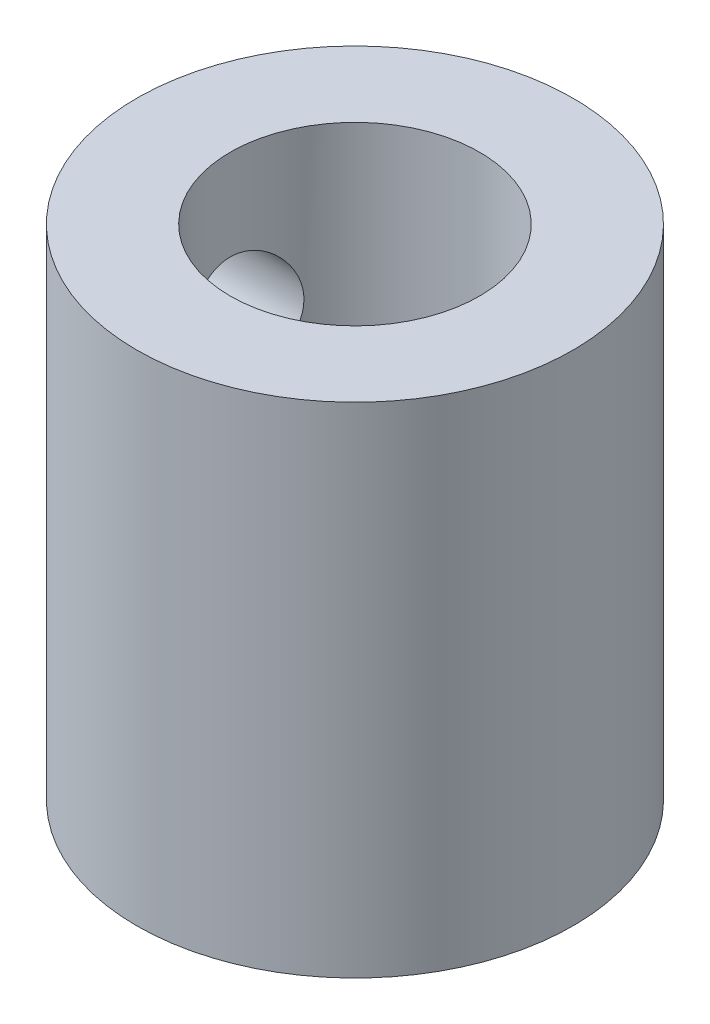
from build123d import *

# Parameters (mm, degrees)
SKETCH1_R           = 5.55625
SKETCH1_R_2         = 1.5875
BOSS_EXTRUDE1_DEPTH = 12.7
SKETCH2_R           = 3.175
CUT_EXTRUDE1_DEPTH  = 8.255
SKETCH4_R           = 2.8575
CUT_EXTRUDE3_DEPTH  = 3.556
SKETCH3_R           = 1.5
CUT_EXTRUDE2_DEPTH  = 15.93431713


with BuildPart() as part:
    # Sketch1 → Boss-Extrude1 (new body)
    with BuildSketch(Plane(origin=(0, 0, 0), x_dir=(1, 0, 0), z_dir=(0, 1, 0))):
        with Locations(Location((0, 0, 0), (0, 0, 270))):
            Circle(SKETCH1_R)
        with Locations(Location((0, 0, 0), (0, 0, 270))):
            Circle(SKETCH1_R_2, mode=Mode.SUBTRACT)
    extrude(amount=BOSS_EXTRUDE1_DEPTH)

    # Sketch2 → Cut-Extrude1 (cut)
    with BuildSketch(Plane(origin=(0, 12.7, 0), x_dir=(1, 0, 0), z_dir=(0, 1, 0))):
        with Locations(Location((0, 0, 0), (0, 0, 270))):
            Circle(SKETCH2_R)
    extrude(amount=-CUT_EXTRUDE1_DEPTH, mode=Mode.SUBTRACT)

    # Sketch4 → Cut-Extrude3 (cut)
    with BuildSketch(Plane.XZ):
        with Locations(Location((0, 0, 0), (0, 0, 270))):
            Circle(SKETCH4_R)
    extrude(amount=-CUT_EXTRUDE3_DEPTH, mode=Mode.SUBTRACT)

    # Sketch3 → Cut-Extrude2 (cut, through all)
    with BuildSketch(Plane(origin=(0, 0, 0), x_dir=(0, 0, -1), z_dir=(1, 0, 0))):
        with Locations((0, 8.89)):
            Circle(SKETCH3_R)
    extrude(amount=-CUT_EXTRUDE2_DEPTH, mode=Mode.SUBTRACT)


solid = part.part
